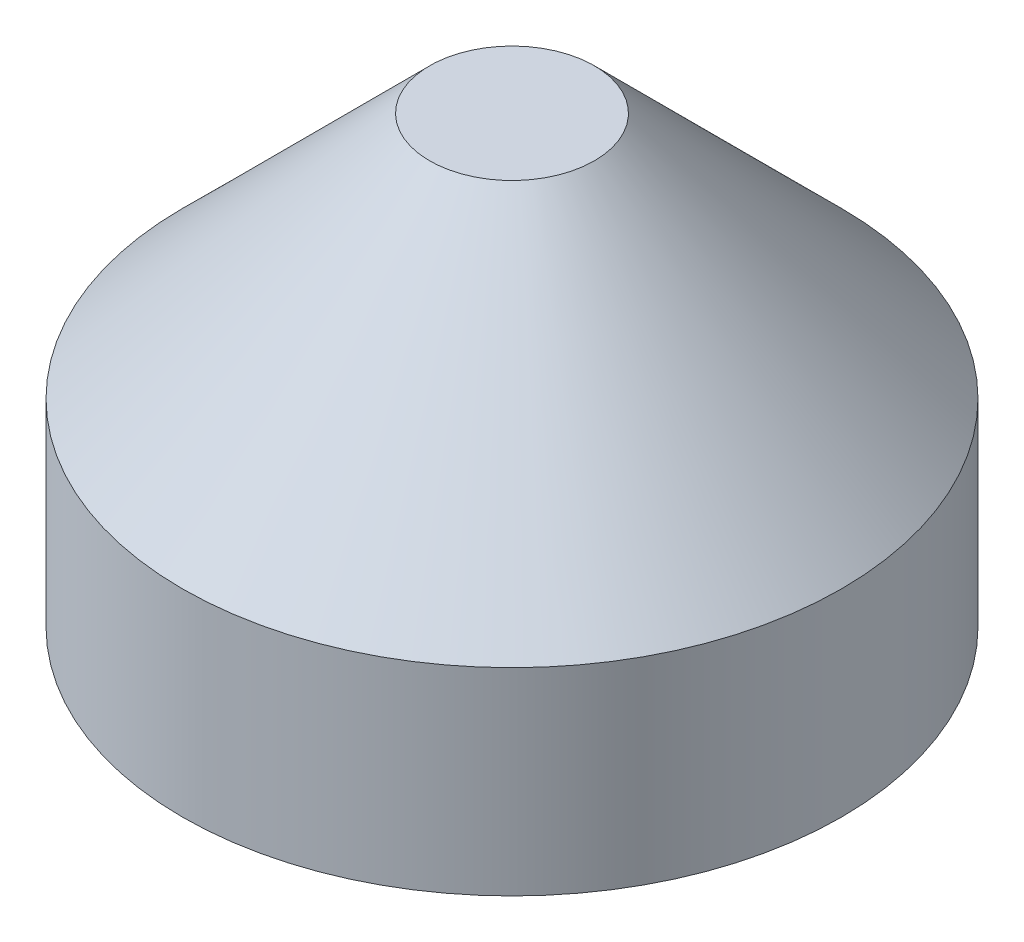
ISO-10303-21;
HEADER;
FILE_DESCRIPTION(('STEP AP214'),'2;1');
FILE_NAME('part.step','',(''),(''),'','','');
FILE_SCHEMA(('AUTOMOTIVE_DESIGN { 1 0 10303 214 1 1 1 1 }'));
ENDSEC;
DATA;
#1=APPLICATION_CONTEXT('core data for automotive mechanical design processes');
#2=APPLICATION_PROTOCOL_DEFINITION('international standard','automotive_design',2000,#1);
#3=PRODUCT_CONTEXT('',#1,'mechanical');
#4=PRODUCT('Part','Part','',(#3));
#5=PRODUCT_RELATED_PRODUCT_CATEGORY('part','',(#4));
#6=PRODUCT_DEFINITION_FORMATION('','',#4);
#7=PRODUCT_DEFINITION_CONTEXT('part definition',#1,'design');
#8=PRODUCT_DEFINITION('design','',#6,#7);
#9=PRODUCT_DEFINITION_SHAPE('','',#8);
#10=(LENGTH_UNIT() NAMED_UNIT(*) SI_UNIT(.MILLI.,.METRE.));
#11=(NAMED_UNIT(*) PLANE_ANGLE_UNIT() SI_UNIT($,.RADIAN.));
#12=(NAMED_UNIT(*) SI_UNIT($,.STERADIAN.) SOLID_ANGLE_UNIT());
#13=UNCERTAINTY_MEASURE_WITH_UNIT(LENGTH_MEASURE(1.E-05),#10,'distance_accuracy_value','');
#14=(GEOMETRIC_REPRESENTATION_CONTEXT(3) GLOBAL_UNCERTAINTY_ASSIGNED_CONTEXT((#13)) GLOBAL_UNIT_ASSIGNED_CONTEXT((#10,
#11,#12)) REPRESENTATION_CONTEXT('',''));
#15=CARTESIAN_POINT('',(0.,0.,0.));
#16=DIRECTION('',(0.,0.,1.));
#17=DIRECTION('',(1.,0.,0.));
#18=AXIS2_PLACEMENT_3D('',#15,#16,#17);
#19=CARTESIAN_POINT('',(1.076758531E-06,18.,6.50000000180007));
#20=DIRECTION('',(0.,-1.,0.));
#21=DIRECTION('',(0.,0.,-1.));
#22=AXIS2_PLACEMENT_3D('',#19,#20,#21);
#23=PLANE('',#22);
#24=DIRECTION('',(0.,0.,-1.));
#25=VECTOR('',#24,1.);
#26=CARTESIAN_POINT('',(2.00000107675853,18.,5.34529946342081));
#27=LINE('',#26,#25);
#28=CARTESIAN_POINT('',(2.00000107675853,18.,5.34529946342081));
#29=VERTEX_POINT('',#28);
#30=CARTESIAN_POINT('',(2.00000107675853,18.,7.65470054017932));
#31=VERTEX_POINT('',#30);
#32=EDGE_CURVE('E133',#29,#31,#27,.F.);
#33=ORIENTED_EDGE('',*,*,#32,.T.);
#34=DIRECTION('',(0.866025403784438,0.,-0.500000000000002));
#35=VECTOR('',#34,1.);
#36=CARTESIAN_POINT('',(2.00000107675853,18.,7.65470054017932));
#37=LINE('',#36,#35);
#38=CARTESIAN_POINT('',(1.07675854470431E-06,18.,8.80940107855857));
#39=VERTEX_POINT('',#38);
#40=EDGE_CURVE('E138',#31,#39,#37,.F.);
#41=ORIENTED_EDGE('',*,*,#40,.T.);
#42=DIRECTION('',(0.86602540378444,0.,0.499999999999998));
#43=VECTOR('',#42,1.);
#44=CARTESIAN_POINT('',(1.07675854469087E-06,18.,8.80940107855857));
#45=LINE('',#44,#43);
#46=CARTESIAN_POINT('',(-1.99999892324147,18.,7.65470054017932));
#47=VERTEX_POINT('',#46);
#48=EDGE_CURVE('E144',#39,#47,#45,.F.);
#49=ORIENTED_EDGE('',*,*,#48,.T.);
#50=DIRECTION('',(0.,0.,1.));
#51=VECTOR('',#50,1.);
#52=CARTESIAN_POINT('',(-1.99999892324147,18.,7.65470054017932));
#53=LINE('',#52,#51);
#54=CARTESIAN_POINT('',(-1.99999892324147,18.,5.34529946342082));
#55=VERTEX_POINT('',#54);
#56=EDGE_CURVE('E94',#47,#55,#53,.F.);
#57=ORIENTED_EDGE('',*,*,#56,.T.);
#58=DIRECTION('',(-0.866025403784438,0.,0.500000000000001));
#59=VECTOR('',#58,1.);
#60=CARTESIAN_POINT('',(-1.99999892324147,18.,5.34529946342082));
#61=LINE('',#60,#59);
#62=CARTESIAN_POINT('',(1.07675853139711E-06,18.,4.19059892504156));
#63=VERTEX_POINT('',#62);
#64=EDGE_CURVE('E92',#55,#63,#61,.F.);
#65=ORIENTED_EDGE('',*,*,#64,.T.);
#66=DIRECTION('',(-0.866025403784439,0.,-0.499999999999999));
#67=VECTOR('',#66,1.);
#68=CARTESIAN_POINT('',(1.07675853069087E-06,18.,4.19059892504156));
#69=LINE('',#68,#67);
#70=EDGE_CURVE('E79',#63,#29,#69,.F.);
#71=ORIENTED_EDGE('',*,*,#70,.T.);
#72=EDGE_LOOP('',(#33,#41,#49,#57,#65,#71));
#73=FACE_BOUND('',#72,.T.);
#74=ADVANCED_FACE('F16',(#73),#23,.T.);
#75=CARTESIAN_POINT('',(1.076758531E-06,15.,4.19059892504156));
#76=DIRECTION('',(0.499999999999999,0.,-0.866025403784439));
#77=DIRECTION('',(-0.866025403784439,0.,-0.499999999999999));
#78=AXIS2_PLACEMENT_3D('',#75,#76,#77);
#79=PLANE('',#78);
#80=DIRECTION('',(0.,1.,0.));
#81=VECTOR('',#80,1.);
#82=CARTESIAN_POINT('',(1.07675853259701E-06,15.,4.19059892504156));
#83=LINE('',#82,#81);
#84=CARTESIAN_POINT('',(1.07675853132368E-06,15.,4.19059892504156));
#85=VERTEX_POINT('',#84);
#86=EDGE_CURVE('E83',#63,#85,#83,.F.);
#87=ORIENTED_EDGE('',*,*,#86,.T.);
#88=DIRECTION('',(-0.866025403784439,0.,-0.5));
#89=VECTOR('',#88,1.);
#90=CARTESIAN_POINT('',(2.00000107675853,15.,5.34529946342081));
#91=LINE('',#90,#89);
#92=CARTESIAN_POINT('',(2.00000107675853,15.,5.34529946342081));
#93=VERTEX_POINT('',#92);
#94=EDGE_CURVE('E131',#93,#85,#91,.T.);
#95=ORIENTED_EDGE('',*,*,#94,.F.);
#96=DIRECTION('',(0.,1.,0.));
#97=VECTOR('',#96,1.);
#98=CARTESIAN_POINT('',(2.00000107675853,15.,5.34529946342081));
#99=LINE('',#98,#97);
#100=EDGE_CURVE('E86',#93,#29,#99,.T.);
#101=ORIENTED_EDGE('',*,*,#100,.T.);
#102=ORIENTED_EDGE('',*,*,#70,.F.);
#103=EDGE_LOOP('',(#87,#95,#101,#102));
#104=FACE_BOUND('',#103,.T.);
#105=ADVANCED_FACE('F81',(#104),#79,.F.);
#106=CARTESIAN_POINT('',(-1.99999892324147,15.,5.34529946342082));
#107=DIRECTION('',(-0.500000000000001,0.,-0.866025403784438));
#108=DIRECTION('',(-0.866025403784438,0.,0.500000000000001));
#109=AXIS2_PLACEMENT_3D('',#106,#107,#108);
#110=PLANE('',#109);
#111=DIRECTION('',(0.,1.,0.));
#112=VECTOR('',#111,1.);
#113=CARTESIAN_POINT('',(-1.99999892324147,15.,5.34529946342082));
#114=LINE('',#113,#112);
#115=CARTESIAN_POINT('',(-1.99999892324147,15.,5.34529946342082));
#116=VERTEX_POINT('',#115);
#117=EDGE_CURVE('E97',#55,#116,#114,.F.);
#118=ORIENTED_EDGE('',*,*,#117,.T.);
#119=DIRECTION('',(-0.866025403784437,0.,0.500000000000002));
#120=VECTOR('',#119,1.);
#121=CARTESIAN_POINT('',(1.07675853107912E-06,15.,4.19059892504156));
#122=LINE('',#121,#120);
#123=EDGE_CURVE('E101',#85,#116,#122,.T.);
#124=ORIENTED_EDGE('',*,*,#123,.F.);
#125=ORIENTED_EDGE('',*,*,#86,.F.);
#126=ORIENTED_EDGE('',*,*,#64,.F.);
#127=EDGE_LOOP('',(#118,#124,#125,#126));
#128=FACE_BOUND('',#127,.T.);
#129=ADVANCED_FACE('F99',(#128),#110,.F.);
#130=CARTESIAN_POINT('',(-1.99999892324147,15.,7.65470054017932));
#131=DIRECTION('',(-1.,0.,0.));
#132=DIRECTION('',(0.,0.,1.));
#133=AXIS2_PLACEMENT_3D('',#130,#131,#132);
#134=PLANE('',#133);
#135=DIRECTION('',(0.,1.,0.));
#136=VECTOR('',#135,1.);
#137=CARTESIAN_POINT('',(-1.99999892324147,15.,7.65470054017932));
#138=LINE('',#137,#136);
#139=CARTESIAN_POINT('',(-1.99999892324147,15.,7.65470054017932));
#140=VERTEX_POINT('',#139);
#141=EDGE_CURVE('E147',#47,#140,#138,.F.);
#142=ORIENTED_EDGE('',*,*,#141,.T.);
#143=DIRECTION('',(0.,0.,-1.));
#144=VECTOR('',#143,1.);
#145=CARTESIAN_POINT('',(-1.99999892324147,15.,6.50000000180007));
#146=LINE('',#145,#144);
#147=EDGE_CURVE('E127',#116,#140,#146,.F.);
#148=ORIENTED_EDGE('',*,*,#147,.F.);
#149=ORIENTED_EDGE('',*,*,#117,.F.);
#150=ORIENTED_EDGE('',*,*,#56,.F.);
#151=EDGE_LOOP('',(#142,#148,#149,#150));
#152=FACE_BOUND('',#151,.T.);
#153=ADVANCED_FACE('F151',(#152),#134,.F.);
#154=CARTESIAN_POINT('',(1.076758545E-06,15.,8.80940107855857));
#155=DIRECTION('',(-0.499999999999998,0.,0.86602540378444));
#156=DIRECTION('',(0.86602540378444,0.,0.499999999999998));
#157=AXIS2_PLACEMENT_3D('',#154,#155,#156);
#158=PLANE('',#157);
#159=DIRECTION('',(0.,1.,0.));
#160=VECTOR('',#159,1.);
#161=CARTESIAN_POINT('',(1.07675854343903E-06,15.,8.80940107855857));
#162=LINE('',#161,#160);
#163=CARTESIAN_POINT('',(1.07675854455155E-06,15.,8.80940107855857));
#164=VERTEX_POINT('',#163);
#165=EDGE_CURVE('E141',#39,#164,#162,.F.);
#166=ORIENTED_EDGE('',*,*,#165,.T.);
#167=DIRECTION('',(0.86602540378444,0.,0.499999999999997));
#168=VECTOR('',#167,1.);
#169=CARTESIAN_POINT('',(-1.99999892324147,15.,7.65470054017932));
#170=LINE('',#169,#168);
#171=EDGE_CURVE('E124',#140,#164,#170,.T.);
#172=ORIENTED_EDGE('',*,*,#171,.F.);
#173=ORIENTED_EDGE('',*,*,#141,.F.);
#174=ORIENTED_EDGE('',*,*,#48,.F.);
#175=EDGE_LOOP('',(#166,#172,#173,#174));
#176=FACE_BOUND('',#175,.T.);
#177=ADVANCED_FACE('F165',(#176),#158,.F.);
#178=CARTESIAN_POINT('',(2.00000107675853,15.,7.65470054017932));
#179=DIRECTION('',(0.500000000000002,0.,0.866025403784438));
#180=DIRECTION('',(0.866025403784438,0.,-0.500000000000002));
#181=AXIS2_PLACEMENT_3D('',#178,#179,#180);
#182=PLANE('',#181);
#183=DIRECTION('',(0.,1.,0.));
#184=VECTOR('',#183,1.);
#185=CARTESIAN_POINT('',(2.00000107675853,15.,7.65470054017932));
#186=LINE('',#185,#184);
#187=CARTESIAN_POINT('',(2.00000107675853,15.,7.65470054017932));
#188=VERTEX_POINT('',#187);
#189=EDGE_CURVE('E136',#31,#188,#186,.F.);
#190=ORIENTED_EDGE('',*,*,#189,.T.);
#191=DIRECTION('',(0.866025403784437,0.,-0.500000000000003));
#192=VECTOR('',#191,1.);
#193=CARTESIAN_POINT('',(1.07675854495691E-06,15.,8.80940107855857));
#194=LINE('',#193,#192);
#195=EDGE_CURVE('E121',#164,#188,#194,.T.);
#196=ORIENTED_EDGE('',*,*,#195,.F.);
#197=ORIENTED_EDGE('',*,*,#165,.F.);
#198=ORIENTED_EDGE('',*,*,#40,.F.);
#199=EDGE_LOOP('',(#190,#196,#197,#198));
#200=FACE_BOUND('',#199,.T.);
#201=ADVANCED_FACE('F163',(#200),#182,.F.);
#202=CARTESIAN_POINT('',(2.00000107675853,15.,5.34529946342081));
#203=DIRECTION('',(1.,0.,0.));
#204=DIRECTION('',(0.,0.,-1.));
#205=AXIS2_PLACEMENT_3D('',#202,#203,#204);
#206=PLANE('',#205);
#207=ORIENTED_EDGE('',*,*,#100,.F.);
#208=DIRECTION('',(0.,0.,-1.));
#209=VECTOR('',#208,1.);
#210=CARTESIAN_POINT('',(2.00000107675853,15.,6.50000000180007));
#211=LINE('',#210,#209);
#212=EDGE_CURVE('E113',#188,#93,#211,.T.);
#213=ORIENTED_EDGE('',*,*,#212,.F.);
#214=ORIENTED_EDGE('',*,*,#189,.F.);
#215=ORIENTED_EDGE('',*,*,#32,.F.);
#216=EDGE_LOOP('',(#207,#213,#214,#215));
#217=FACE_BOUND('',#216,.T.);
#218=ADVANCED_FACE('F158',(#217),#206,.F.);
#219=CARTESIAN_POINT('',(-1.48038368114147,15.,6.50000000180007));
#220=DIRECTION('',(0.,-1.,0.));
#221=DIRECTION('',(0.,0.,-1.));
#222=AXIS2_PLACEMENT_3D('',#219,#220,#221);
#223=PLANE('',#222);
#224=ORIENTED_EDGE('',*,*,#195,.T.);
#225=ORIENTED_EDGE('',*,*,#212,.T.);
#226=ORIENTED_EDGE('',*,*,#94,.T.);
#227=ORIENTED_EDGE('',*,*,#123,.T.);
#228=ORIENTED_EDGE('',*,*,#147,.T.);
#229=ORIENTED_EDGE('',*,*,#171,.T.);
#230=EDGE_LOOP('',(#224,#225,#226,#227,#228,#229));
#231=FACE_BOUND('',#230,.T.);
#232=CARTESIAN_POINT('',(1.07675853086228E-06,14.9999999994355,6.50000000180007));
#233=DIRECTION('',(0.,1.,0.));
#234=DIRECTION('',(0.,0.,1.));
#235=AXIS2_PLACEMENT_3D('',#232,#233,#234);
#236=CIRCLE('',#235,2.96076951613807);
#237=CARTESIAN_POINT('',(2.9607705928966,14.9999999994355,6.50000000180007));
#238=VERTEX_POINT('',#237);
#239=EDGE_CURVE('E19',#238,#238,#236,.T.);
#240=ORIENTED_EDGE('',*,*,#239,.F.);
#241=EDGE_LOOP('',(#240));
#242=FACE_BOUND('',#241,.T.);
#243=ADVANCED_FACE('F155',(#231,#242),#223,.T.);
#244=CARTESIAN_POINT('',(1.07675853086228E-06,15.6000000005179,6.50000000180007));
#245=DIRECTION('',(0.,1.,0.));
#246=DIRECTION('',(0.,0.,1.));
#247=AXIS2_PLACEMENT_3D('',#244,#245,#246);
#248=CONICAL_SURFACE('',#247,3.99999999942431,1.04719754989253);
#249=ORIENTED_EDGE('',*,*,#239,.T.);
#250=EDGE_LOOP('',(#249));
#251=FACE_BOUND('',#250,.T.);
#252=CARTESIAN_POINT('',(1.076758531E-06,15.6,6.50000000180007));
#253=DIRECTION('',(0.,-1.,0.));
#254=DIRECTION('',(0.,0.,-1.));
#255=AXIS2_PLACEMENT_3D('',#252,#253,#254);
#256=CIRCLE('',#255,4.);
#257=CARTESIAN_POINT('',(4.00000107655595,15.6000000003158,6.50000000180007));
#258=VERTEX_POINT('',#257);
#259=EDGE_CURVE('E36',#258,#258,#256,.F.);
#260=ORIENTED_EDGE('',*,*,#259,.F.);
#261=EDGE_LOOP('',(#260));
#262=FACE_BOUND('',#261,.T.);
#263=ADVANCED_FACE('F189',(#251,#262),#248,.T.);
#264=CARTESIAN_POINT('',(1.076758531E-06,21.,6.50000000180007));
#265=DIRECTION('',(0.,-1.,0.));
#266=DIRECTION('',(0.,0.,-1.));
#267=AXIS2_PLACEMENT_3D('',#264,#265,#266);
#268=PLANE('',#267);
#269=CARTESIAN_POINT('',(1.07675853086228E-06,21.0000000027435,6.50000000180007));
#270=DIRECTION('',(0.,-1.,0.));
#271=DIRECTION('',(0.,0.,-1.));
#272=AXIS2_PLACEMENT_3D('',#269,#270,#271);
#273=CIRCLE('',#272,1.00000000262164);
#274=CARTESIAN_POINT('',(1.00000107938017,21.0000000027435,6.50000000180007));
#275=VERTEX_POINT('',#274);
#276=EDGE_CURVE('E25',#275,#275,#273,.T.);
#277=ORIENTED_EDGE('',*,*,#276,.F.);
#278=EDGE_LOOP('',(#277));
#279=FACE_BOUND('',#278,.T.);
#280=ADVANCED_FACE('F184',(#279),#268,.F.);
#281=CARTESIAN_POINT('',(1.076758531E-06,17.8,6.50000000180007));
#282=DIRECTION('',(0.,-1.,0.));
#283=DIRECTION('',(0.,0.,-1.));
#284=AXIS2_PLACEMENT_3D('',#281,#282,#283);
#285=CYLINDRICAL_SURFACE('',#284,4.);
#286=ORIENTED_EDGE('',*,*,#259,.T.);
#287=EDGE_LOOP('',(#286));
#288=FACE_BOUND('',#287,.T.);
#289=CARTESIAN_POINT('',(1.076758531E-06,18.0000000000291,6.50000000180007));
#290=DIRECTION('',(0.,-1.,0.));
#291=DIRECTION('',(-1.,0.,0.));
#292=AXIS2_PLACEMENT_3D('',#289,#290,#291);
#293=CIRCLE('',#292,3.9999999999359);
#294=CARTESIAN_POINT('',(4.00000107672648,18.0000000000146,6.50000000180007));
#295=VERTEX_POINT('',#294);
#296=EDGE_CURVE('E11',#295,#295,#293,.F.);
#297=ORIENTED_EDGE('',*,*,#296,.F.);
#298=EDGE_LOOP('',(#297));
#299=FACE_BOUND('',#298,.T.);
#300=ADVANCED_FACE('F177',(#288,#299),#285,.T.);
#301=CARTESIAN_POINT('',(1.07675853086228E-06,18.0000000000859,6.50000000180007));
#302=DIRECTION('',(0.,-1.,0.));
#303=DIRECTION('',(0.,0.,-1.));
#304=AXIS2_PLACEMENT_3D('',#301,#302,#303);
#305=CONICAL_SURFACE('',#304,3.99999999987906,0.785398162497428);
#306=ORIENTED_EDGE('',*,*,#296,.T.);
#307=EDGE_LOOP('',(#306));
#308=FACE_BOUND('',#307,.T.);
#309=ORIENTED_EDGE('',*,*,#276,.T.);
#310=EDGE_LOOP('',(#309));
#311=FACE_BOUND('',#310,.T.);
#312=ADVANCED_FACE('F175',(#308,#311),#305,.T.);
#313=CLOSED_SHELL('',(#74,#105,#129,#153,#177,#201,#218,#243,#263,#280,#300,#312));
#314=MANIFOLD_SOLID_BREP('B1',#313);
#315=ADVANCED_BREP_SHAPE_REPRESENTATION('',(#18,#314),#14);
#316=SHAPE_DEFINITION_REPRESENTATION(#9,#315);
ENDSEC;
END-ISO-10303-21;
